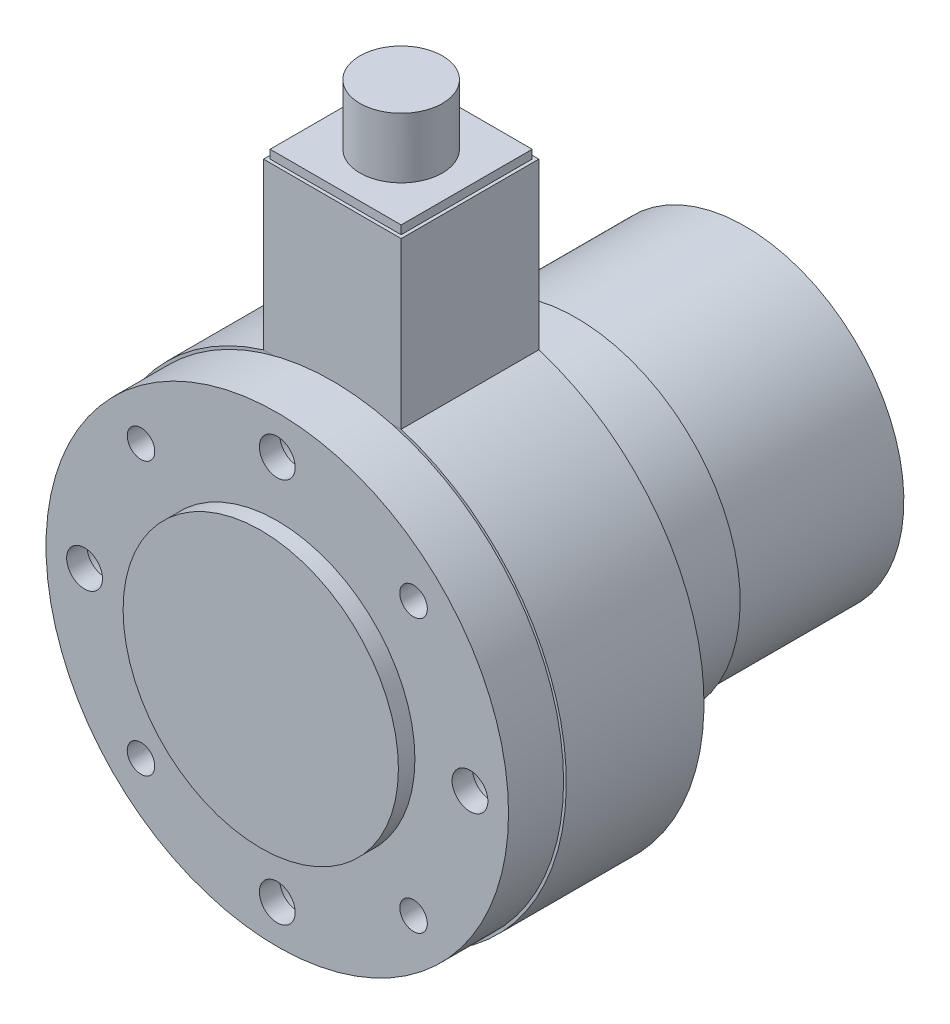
ISO-10303-21;
HEADER;
FILE_DESCRIPTION(('STEP AP214'),'2;1');
FILE_NAME('part.step','',(''),(''),'','','');
FILE_SCHEMA(('AUTOMOTIVE_DESIGN { 1 0 10303 214 1 1 1 1 }'));
ENDSEC;
DATA;
#1=APPLICATION_CONTEXT('core data for automotive mechanical design processes');
#2=APPLICATION_PROTOCOL_DEFINITION('international standard','automotive_design',2000,#1);
#3=PRODUCT_CONTEXT('',#1,'mechanical');
#4=PRODUCT('Part','Part','',(#3));
#5=PRODUCT_RELATED_PRODUCT_CATEGORY('part','',(#4));
#6=PRODUCT_DEFINITION_FORMATION('','',#4);
#7=PRODUCT_DEFINITION_CONTEXT('part definition',#1,'design');
#8=PRODUCT_DEFINITION('design','',#6,#7);
#9=PRODUCT_DEFINITION_SHAPE('','',#8);
#10=(LENGTH_UNIT() NAMED_UNIT(*) SI_UNIT(.MILLI.,.METRE.));
#11=(NAMED_UNIT(*) PLANE_ANGLE_UNIT() SI_UNIT($,.RADIAN.));
#12=(NAMED_UNIT(*) SI_UNIT($,.STERADIAN.) SOLID_ANGLE_UNIT());
#13=UNCERTAINTY_MEASURE_WITH_UNIT(LENGTH_MEASURE(1.E-05),#10,'distance_accuracy_value','');
#14=(GEOMETRIC_REPRESENTATION_CONTEXT(3) GLOBAL_UNCERTAINTY_ASSIGNED_CONTEXT((#13)) GLOBAL_UNIT_ASSIGNED_CONTEXT((#10,
#11,#12)) REPRESENTATION_CONTEXT('',''));
#15=CARTESIAN_POINT('',(0.,0.,0.));
#16=DIRECTION('',(0.,0.,1.));
#17=DIRECTION('',(1.,0.,0.));
#18=AXIS2_PLACEMENT_3D('',#15,#16,#17);
#19=CARTESIAN_POINT('',(0.,0.,-39.));
#20=DIRECTION('',(0.,0.,-1.));
#21=DIRECTION('',(-0.991649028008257,-0.128965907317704,0.));
#22=AXIS2_PLACEMENT_3D('',#19,#20,#21);
#23=CYLINDRICAL_SURFACE('',#22,28.8);
#24=CARTESIAN_POINT('',(0.,0.,-39.));
#25=DIRECTION('',(0.,0.,1.));
#26=DIRECTION('',(0.991649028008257,0.128965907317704,0.));
#27=AXIS2_PLACEMENT_3D('',#24,#25,#26);
#28=CIRCLE('',#27,28.8);
#29=CARTESIAN_POINT('',(28.5594920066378,3.71421813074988,-39.));
#30=VERTEX_POINT('',#29);
#31=EDGE_CURVE('P0_E9',#30,#30,#28,.T.);
#32=ORIENTED_EDGE('',*,*,#31,.F.);
#33=EDGE_LOOP('',(#32));
#34=FACE_BOUND('',#33,.T.);
#35=CARTESIAN_POINT('',(0.,0.,-75.));
#36=DIRECTION('',(0.,0.,1.));
#37=DIRECTION('',(0.991649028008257,0.128965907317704,0.));
#38=AXIS2_PLACEMENT_3D('',#35,#36,#37);
#39=CIRCLE('',#38,28.8);
#40=CARTESIAN_POINT('',(28.5594920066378,3.71421813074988,-75.));
#41=VERTEX_POINT('',#40);
#42=EDGE_CURVE('P0_E16',#41,#41,#39,.T.);
#43=ORIENTED_EDGE('',*,*,#42,.T.);
#44=EDGE_LOOP('',(#43));
#45=FACE_BOUND('',#44,.T.);
#46=ADVANCED_FACE('P0_F13',(#34,#45),#23,.T.);
#47=CARTESIAN_POINT('',(0.,0.,-39.));
#48=DIRECTION('',(0.,0.,1.));
#49=DIRECTION('',(0.991649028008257,0.128965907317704,0.));
#50=AXIS2_PLACEMENT_3D('',#47,#48,#49);
#51=PLANE('',#50);
#52=ORIENTED_EDGE('',*,*,#31,.T.);
#53=EDGE_LOOP('',(#52));
#54=FACE_BOUND('',#53,.T.);
#55=ADVANCED_FACE('P0_F28',(#54),#51,.T.);
#56=CARTESIAN_POINT('',(0.,0.,-75.));
#57=DIRECTION('',(0.,0.,1.));
#58=DIRECTION('',(0.991649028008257,0.128965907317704,0.));
#59=AXIS2_PLACEMENT_3D('',#56,#57,#58);
#60=PLANE('',#59);
#61=ORIENTED_EDGE('',*,*,#42,.F.);
#62=EDGE_LOOP('',(#61));
#63=FACE_BOUND('',#62,.T.);
#64=ADVANCED_FACE('P0_F26',(#63),#60,.F.);
#65=CLOSED_SHELL('',(#46,#55,#64));
#66=MANIFOLD_SOLID_BREP('P0_B1',#65);
#67=CARTESIAN_POINT('',(-11.8999999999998,70.6201920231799,-24.4));
#68=DIRECTION('',(0.,0.,1.));
#69=DIRECTION('',(-1.,0.,0.));
#70=AXIS2_PLACEMENT_3D('',#67,#68,#69);
#71=PLANE('',#70);
#72=DIRECTION('',(1.,0.,0.));
#73=VECTOR('',#72,1.);
#74=CARTESIAN_POINT('',(-11.8999999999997,72.1701920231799,-24.4));
#75=LINE('',#74,#73);
#76=CARTESIAN_POINT('',(-11.8999999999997,72.1701920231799,-24.4));
#77=VERTEX_POINT('',#76);
#78=CARTESIAN_POINT('',(11.9000000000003,72.1701920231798,-24.4));
#79=VERTEX_POINT('',#78);
#80=EDGE_CURVE('P1_E82',#77,#79,#75,.T.);
#81=ORIENTED_EDGE('',*,*,#80,.T.);
#82=DIRECTION('',(0.,1.,0.));
#83=VECTOR('',#82,1.);
#84=CARTESIAN_POINT('',(11.9000000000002,70.6201920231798,-24.4));
#85=LINE('',#84,#83);
#86=CARTESIAN_POINT('',(11.9000000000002,70.6201920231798,-24.4));
#87=VERTEX_POINT('',#86);
#88=EDGE_CURVE('P1_E24',#87,#79,#85,.T.);
#89=ORIENTED_EDGE('',*,*,#88,.F.);
#90=DIRECTION('',(1.,0.,0.));
#91=VECTOR('',#90,1.);
#92=CARTESIAN_POINT('',(-11.8999999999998,70.6201920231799,-24.4));
#93=LINE('',#92,#91);
#94=CARTESIAN_POINT('',(-11.8999999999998,70.6201920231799,-24.4));
#95=VERTEX_POINT('',#94);
#96=EDGE_CURVE('P1_E68',#95,#87,#93,.T.);
#97=ORIENTED_EDGE('',*,*,#96,.F.);
#98=DIRECTION('',(0.,1.,0.));
#99=VECTOR('',#98,1.);
#100=CARTESIAN_POINT('',(-11.8999999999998,70.6201920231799,-24.4));
#101=LINE('',#100,#99);
#102=EDGE_CURVE('P1_E78',#95,#77,#101,.T.);
#103=ORIENTED_EDGE('',*,*,#102,.T.);
#104=EDGE_LOOP('',(#81,#89,#97,#103));
#105=FACE_BOUND('',#104,.T.);
#106=ADVANCED_FACE('P1_F16',(#105),#71,.F.);
#107=CARTESIAN_POINT('',(11.9000000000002,70.6201920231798,-24.4));
#108=DIRECTION('',(-1.,0.,0.));
#109=DIRECTION('',(0.,-1.,0.));
#110=AXIS2_PLACEMENT_3D('',#107,#108,#109);
#111=PLANE('',#110);
#112=DIRECTION('',(0.,0.,1.));
#113=VECTOR('',#112,1.);
#114=CARTESIAN_POINT('',(11.9000000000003,72.1701920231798,-24.4));
#115=LINE('',#114,#113);
#116=CARTESIAN_POINT('',(11.9000000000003,72.1701920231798,-0.599999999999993));
#117=VERTEX_POINT('',#116);
#118=EDGE_CURVE('P1_E73',#79,#117,#115,.T.);
#119=ORIENTED_EDGE('',*,*,#118,.T.);
#120=DIRECTION('',(0.,1.,0.));
#121=VECTOR('',#120,1.);
#122=CARTESIAN_POINT('',(11.9000000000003,70.6201920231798,-0.599999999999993));
#123=LINE('',#122,#121);
#124=CARTESIAN_POINT('',(11.9000000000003,70.6201920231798,-0.599999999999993));
#125=VERTEX_POINT('',#124);
#126=EDGE_CURVE('P1_E71',#125,#117,#123,.T.);
#127=ORIENTED_EDGE('',*,*,#126,.F.);
#128=DIRECTION('',(0.,0.,1.));
#129=VECTOR('',#128,1.);
#130=CARTESIAN_POINT('',(11.9000000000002,70.6201920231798,-24.4));
#131=LINE('',#130,#129);
#132=EDGE_CURVE('P1_E63',#87,#125,#131,.T.);
#133=ORIENTED_EDGE('',*,*,#132,.F.);
#134=ORIENTED_EDGE('',*,*,#88,.T.);
#135=EDGE_LOOP('',(#119,#127,#133,#134));
#136=FACE_BOUND('',#135,.T.);
#137=ADVANCED_FACE('P1_F72',(#136),#111,.F.);
#138=CARTESIAN_POINT('',(-11.8999999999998,70.6201920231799,-0.599999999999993));
#139=DIRECTION('',(0.,0.,-1.));
#140=DIRECTION('',(1.,0.,0.));
#141=AXIS2_PLACEMENT_3D('',#138,#139,#140);
#142=PLANE('',#141);
#143=DIRECTION('',(-1.,0.,0.));
#144=VECTOR('',#143,1.);
#145=CARTESIAN_POINT('',(-11.8999999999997,72.1701920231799,-0.599999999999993));
#146=LINE('',#145,#144);
#147=CARTESIAN_POINT('',(-11.8999999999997,72.1701920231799,-0.599999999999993));
#148=VERTEX_POINT('',#147);
#149=EDGE_CURVE('P1_E49',#117,#148,#146,.T.);
#150=ORIENTED_EDGE('',*,*,#149,.T.);
#151=DIRECTION('',(0.,1.,0.));
#152=VECTOR('',#151,1.);
#153=CARTESIAN_POINT('',(-11.8999999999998,70.6201920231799,-0.599999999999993));
#154=LINE('',#153,#152);
#155=CARTESIAN_POINT('',(-11.8999999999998,70.6201920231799,-0.599999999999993));
#156=VERTEX_POINT('',#155);
#157=EDGE_CURVE('P1_E74',#156,#148,#154,.T.);
#158=ORIENTED_EDGE('',*,*,#157,.F.);
#159=DIRECTION('',(-1.,0.,0.));
#160=VECTOR('',#159,1.);
#161=CARTESIAN_POINT('',(-11.8999999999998,70.6201920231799,-0.599999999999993));
#162=LINE('',#161,#160);
#163=EDGE_CURVE('P1_E66',#125,#156,#162,.T.);
#164=ORIENTED_EDGE('',*,*,#163,.F.);
#165=ORIENTED_EDGE('',*,*,#126,.T.);
#166=EDGE_LOOP('',(#150,#158,#164,#165));
#167=FACE_BOUND('',#166,.T.);
#168=ADVANCED_FACE('P1_F76',(#167),#142,.F.);
#169=CARTESIAN_POINT('',(-11.8999999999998,70.6201920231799,-24.4));
#170=DIRECTION('',(1.,0.,0.));
#171=DIRECTION('',(0.,1.,0.));
#172=AXIS2_PLACEMENT_3D('',#169,#170,#171);
#173=PLANE('',#172);
#174=DIRECTION('',(0.,0.,-1.));
#175=VECTOR('',#174,1.);
#176=CARTESIAN_POINT('',(-11.8999999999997,72.1701920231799,-24.4));
#177=LINE('',#176,#175);
#178=EDGE_CURVE('P1_E55',#148,#77,#177,.T.);
#179=ORIENTED_EDGE('',*,*,#178,.T.);
#180=ORIENTED_EDGE('',*,*,#102,.F.);
#181=DIRECTION('',(0.,0.,-1.));
#182=VECTOR('',#181,1.);
#183=CARTESIAN_POINT('',(-11.8999999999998,70.6201920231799,-24.4));
#184=LINE('',#183,#182);
#185=EDGE_CURVE('P1_E32',#156,#95,#184,.T.);
#186=ORIENTED_EDGE('',*,*,#185,.F.);
#187=ORIENTED_EDGE('',*,*,#157,.T.);
#188=EDGE_LOOP('',(#179,#180,#186,#187));
#189=FACE_BOUND('',#188,.T.);
#190=ADVANCED_FACE('P1_F106',(#189),#173,.F.);
#191=CARTESIAN_POINT('',(11.9000000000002,70.6201920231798,-24.4));
#192=DIRECTION('',(0.,-1.,0.));
#193=DIRECTION('',(0.,0.,1.));
#194=AXIS2_PLACEMENT_3D('',#191,#192,#193);
#195=PLANE('',#194);
#196=ORIENTED_EDGE('',*,*,#96,.T.);
#197=ORIENTED_EDGE('',*,*,#132,.T.);
#198=ORIENTED_EDGE('',*,*,#163,.T.);
#199=ORIENTED_EDGE('',*,*,#185,.T.);
#200=EDGE_LOOP('',(#196,#197,#198,#199));
#201=FACE_BOUND('',#200,.T.);
#202=ADVANCED_FACE('P1_F64',(#201),#195,.T.);
#203=CARTESIAN_POINT('',(11.9000000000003,72.1701920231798,-24.4));
#204=DIRECTION('',(0.,-1.,0.));
#205=DIRECTION('',(0.,0.,1.));
#206=AXIS2_PLACEMENT_3D('',#203,#204,#205);
#207=PLANE('',#206);
#208=CARTESIAN_POINT('',(2.55004350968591E-13,72.1701920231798,-12.5));
#209=DIRECTION('',(0.,-1.,0.));
#210=DIRECTION('',(0.,0.,1.));
#211=AXIS2_PLACEMENT_3D('',#208,#209,#210);
#212=CIRCLE('',#211,7.49);
#213=CARTESIAN_POINT('',(2.55921581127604E-13,72.1701920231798,-5.00999999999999));
#214=VERTEX_POINT('',#213);
#215=EDGE_CURVE('P1_E11',#214,#214,#212,.F.);
#216=ORIENTED_EDGE('',*,*,#215,.F.);
#217=EDGE_LOOP('',(#216));
#218=FACE_BOUND('',#217,.T.);
#219=ORIENTED_EDGE('',*,*,#80,.F.);
#220=ORIENTED_EDGE('',*,*,#178,.F.);
#221=ORIENTED_EDGE('',*,*,#149,.F.);
#222=ORIENTED_EDGE('',*,*,#118,.F.);
#223=EDGE_LOOP('',(#219,#220,#221,#222));
#224=FACE_BOUND('',#223,.T.);
#225=ADVANCED_FACE('P1_F93',(#218,#224),#207,.F.);
#226=CARTESIAN_POINT('',(2.94902990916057E-13,83.1201920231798,-12.5));
#227=DIRECTION('',(0.,-1.,0.));
#228=DIRECTION('',(0.,0.,1.));
#229=AXIS2_PLACEMENT_3D('',#226,#227,#228);
#230=CYLINDRICAL_SURFACE('',#229,7.49);
#231=CARTESIAN_POINT('',(2.94902990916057E-13,83.1201920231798,-12.5));
#232=DIRECTION('',(0.,1.,0.));
#233=DIRECTION('',(0.,0.,-1.));
#234=AXIS2_PLACEMENT_3D('',#231,#232,#233);
#235=CIRCLE('',#234,7.49);
#236=CARTESIAN_POINT('',(2.93985760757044E-13,83.1201920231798,-19.99));
#237=VERTEX_POINT('',#236);
#238=EDGE_CURVE('P1_E85',#237,#237,#235,.T.);
#239=ORIENTED_EDGE('',*,*,#238,.F.);
#240=EDGE_LOOP('',(#239));
#241=FACE_BOUND('',#240,.T.);
#242=ORIENTED_EDGE('',*,*,#215,.T.);
#243=EDGE_LOOP('',(#242));
#244=FACE_BOUND('',#243,.T.);
#245=ADVANCED_FACE('P1_F95',(#241,#244),#230,.T.);
#246=CARTESIAN_POINT('',(2.94902990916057E-13,83.1201920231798,-12.5));
#247=DIRECTION('',(0.,1.,0.));
#248=DIRECTION('',(0.,0.,-1.));
#249=AXIS2_PLACEMENT_3D('',#246,#247,#248);
#250=PLANE('',#249);
#251=ORIENTED_EDGE('',*,*,#238,.T.);
#252=EDGE_LOOP('',(#251));
#253=FACE_BOUND('',#252,.T.);
#254=ADVANCED_FACE('P1_F103',(#253),#250,.T.);
#255=CLOSED_SHELL('',(#106,#137,#168,#190,#202,#225,#245,#254));
#256=MANIFOLD_SOLID_BREP('P1_B1',#255);
#257=CARTESIAN_POINT('',(29.4701448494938,0.,-25.));
#258=DIRECTION('',(0.,0.,-1.));
#259=DIRECTION('',(0.,1.,0.));
#260=AXIS2_PLACEMENT_3D('',#257,#258,#259);
#261=PLANE('',#260);
#262=CARTESIAN_POINT('',(0.,0.,-25.));
#263=DIRECTION('',(0.,0.,1.));
#264=DIRECTION('',(0.,-1.,0.));
#265=AXIS2_PLACEMENT_3D('',#262,#263,#264);
#266=CIRCLE('',#265,29.4701448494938);
#267=CARTESIAN_POINT('',(0.,-29.4701448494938,-25.));
#268=VERTEX_POINT('',#267);
#269=EDGE_CURVE('P2_E28',#268,#268,#266,.T.);
#270=ORIENTED_EDGE('',*,*,#269,.F.);
#271=EDGE_LOOP('',(#270));
#272=FACE_BOUND('',#271,.T.);
#273=CARTESIAN_POINT('',(0.,0.,-25.));
#274=DIRECTION('',(0.,0.,1.));
#275=DIRECTION('',(0.,-1.,0.));
#276=AXIS2_PLACEMENT_3D('',#273,#274,#275);
#277=CIRCLE('',#276,29.7701448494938);
#278=CARTESIAN_POINT('',(0.,-29.7701448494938,-25.));
#279=VERTEX_POINT('',#278);
#280=EDGE_CURVE('P2_E10',#279,#279,#277,.T.);
#281=ORIENTED_EDGE('',*,*,#280,.T.);
#282=EDGE_LOOP('',(#281));
#283=FACE_BOUND('',#282,.T.);
#284=ADVANCED_FACE('P2_F14',(#272,#283),#261,.F.);
#285=CARTESIAN_POINT('',(0.,0.,-19.9714581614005));
#286=DIRECTION('',(0.,0.,1.));
#287=DIRECTION('',(0.,-1.,0.));
#288=AXIS2_PLACEMENT_3D('',#285,#286,#287);
#289=CYLINDRICAL_SURFACE('',#288,29.7701448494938);
#290=ORIENTED_EDGE('',*,*,#280,.F.);
#291=EDGE_LOOP('',(#290));
#292=FACE_BOUND('',#291,.T.);
#293=CARTESIAN_POINT('',(0.,0.,-44.3));
#294=DIRECTION('',(0.,0.,1.));
#295=DIRECTION('',(0.,-1.,0.));
#296=AXIS2_PLACEMENT_3D('',#293,#294,#295);
#297=CIRCLE('',#296,29.7701448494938);
#298=CARTESIAN_POINT('',(0.,-29.7701448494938,-44.3));
#299=VERTEX_POINT('',#298);
#300=EDGE_CURVE('P2_E20',#299,#299,#297,.T.);
#301=ORIENTED_EDGE('',*,*,#300,.T.);
#302=EDGE_LOOP('',(#301));
#303=FACE_BOUND('',#302,.T.);
#304=ADVANCED_FACE('P2_F37',(#292,#303),#289,.T.);
#305=CARTESIAN_POINT('',(29.4701448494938,0.,-44.3));
#306=DIRECTION('',(0.,0.,1.));
#307=DIRECTION('',(0.,-1.,0.));
#308=AXIS2_PLACEMENT_3D('',#305,#306,#307);
#309=PLANE('',#308);
#310=ORIENTED_EDGE('',*,*,#300,.F.);
#311=EDGE_LOOP('',(#310));
#312=FACE_BOUND('',#311,.T.);
#313=CARTESIAN_POINT('',(0.,0.,-44.3));
#314=DIRECTION('',(0.,0.,1.));
#315=DIRECTION('',(0.,-1.,0.));
#316=AXIS2_PLACEMENT_3D('',#313,#314,#315);
#317=CIRCLE('',#316,29.4701448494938);
#318=CARTESIAN_POINT('',(0.,-29.4701448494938,-44.3));
#319=VERTEX_POINT('',#318);
#320=EDGE_CURVE('P2_E24',#319,#319,#317,.T.);
#321=ORIENTED_EDGE('',*,*,#320,.T.);
#322=EDGE_LOOP('',(#321));
#323=FACE_BOUND('',#322,.T.);
#324=ADVANCED_FACE('P2_F42',(#312,#323),#309,.F.);
#325=CARTESIAN_POINT('',(0.,0.,-19.9714581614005));
#326=DIRECTION('',(0.,0.,1.));
#327=DIRECTION('',(0.,-1.,0.));
#328=AXIS2_PLACEMENT_3D('',#325,#326,#327);
#329=CYLINDRICAL_SURFACE('',#328,29.4701448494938);
#330=ORIENTED_EDGE('',*,*,#320,.F.);
#331=EDGE_LOOP('',(#330));
#332=FACE_BOUND('',#331,.T.);
#333=ORIENTED_EDGE('',*,*,#269,.T.);
#334=EDGE_LOOP('',(#333));
#335=FACE_BOUND('',#334,.T.);
#336=ADVANCED_FACE('P2_F34',(#332,#335),#329,.F.);
#337=CLOSED_SHELL('',(#284,#304,#324,#336));
#338=MANIFOLD_SOLID_BREP('P2_B1',#337);
#339=CARTESIAN_POINT('',(12.5000000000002,40.6201920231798,0.));
#340=DIRECTION('',(0.,0.,-1.));
#341=DIRECTION('',(1.,0.,0.));
#342=AXIS2_PLACEMENT_3D('',#339,#340,#341);
#343=PLANE('',#342);
#344=DIRECTION('',(-1.,0.,0.));
#345=VECTOR('',#344,1.);
#346=CARTESIAN_POINT('',(12.5000000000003,70.6201920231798,0.));
#347=LINE('',#346,#345);
#348=CARTESIAN_POINT('',(12.5000000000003,70.6201920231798,0.));
#349=VERTEX_POINT('',#348);
#350=CARTESIAN_POINT('',(-12.4999999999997,70.6201920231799,0.));
#351=VERTEX_POINT('',#350);
#352=EDGE_CURVE('P3_E79',#349,#351,#347,.T.);
#353=ORIENTED_EDGE('',*,*,#352,.T.);
#354=DIRECTION('',(0.,1.,0.));
#355=VECTOR('',#354,1.);
#356=CARTESIAN_POINT('',(-12.4999999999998,40.6201920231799,0.));
#357=LINE('',#356,#355);
#358=CARTESIAN_POINT('',(-12.4999999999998,40.6201920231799,0.));
#359=VERTEX_POINT('',#358);
#360=EDGE_CURVE('P3_E11',#359,#351,#357,.T.);
#361=ORIENTED_EDGE('',*,*,#360,.F.);
#362=DIRECTION('',(-1.,0.,0.));
#363=VECTOR('',#362,1.);
#364=CARTESIAN_POINT('',(12.5000000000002,40.6201920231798,0.));
#365=LINE('',#364,#363);
#366=CARTESIAN_POINT('',(12.5000000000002,40.6201920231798,0.));
#367=VERTEX_POINT('',#366);
#368=EDGE_CURVE('P3_E67',#367,#359,#365,.T.);
#369=ORIENTED_EDGE('',*,*,#368,.F.);
#370=DIRECTION('',(0.,1.,0.));
#371=VECTOR('',#370,1.);
#372=CARTESIAN_POINT('',(12.5000000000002,40.6201920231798,0.));
#373=LINE('',#372,#371);
#374=EDGE_CURVE('P3_E75',#367,#349,#373,.T.);
#375=ORIENTED_EDGE('',*,*,#374,.T.);
#376=EDGE_LOOP('',(#353,#361,#369,#375));
#377=FACE_BOUND('',#376,.T.);
#378=ADVANCED_FACE('P3_F16',(#377),#343,.F.);
#379=CARTESIAN_POINT('',(-12.4999999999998,40.6201920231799,0.));
#380=DIRECTION('',(1.,0.,0.));
#381=DIRECTION('',(0.,-1.,0.));
#382=AXIS2_PLACEMENT_3D('',#379,#380,#381);
#383=PLANE('',#382);
#384=DIRECTION('',(0.,0.,-1.));
#385=VECTOR('',#384,1.);
#386=CARTESIAN_POINT('',(-12.4999999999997,70.6201920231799,0.));
#387=LINE('',#386,#385);
#388=CARTESIAN_POINT('',(-12.4999999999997,70.6201920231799,-25.));
#389=VERTEX_POINT('',#388);
#390=EDGE_CURVE('P3_E71',#351,#389,#387,.T.);
#391=ORIENTED_EDGE('',*,*,#390,.T.);
#392=DIRECTION('',(0.,1.,0.));
#393=VECTOR('',#392,1.);
#394=CARTESIAN_POINT('',(-12.4999999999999,40.6201920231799,-25.));
#395=LINE('',#394,#393);
#396=CARTESIAN_POINT('',(-12.4999999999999,40.6201920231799,-25.));
#397=VERTEX_POINT('',#396);
#398=EDGE_CURVE('P3_E24',#397,#389,#395,.T.);
#399=ORIENTED_EDGE('',*,*,#398,.F.);
#400=DIRECTION('',(0.,0.,-1.));
#401=VECTOR('',#400,1.);
#402=CARTESIAN_POINT('',(-12.4999999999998,40.6201920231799,0.));
#403=LINE('',#402,#401);
#404=EDGE_CURVE('P3_E62',#359,#397,#403,.T.);
#405=ORIENTED_EDGE('',*,*,#404,.F.);
#406=ORIENTED_EDGE('',*,*,#360,.T.);
#407=EDGE_LOOP('',(#391,#399,#405,#406));
#408=FACE_BOUND('',#407,.T.);
#409=ADVANCED_FACE('P3_F70',(#408),#383,.F.);
#410=CARTESIAN_POINT('',(12.5000000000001,40.6201920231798,-25.));
#411=DIRECTION('',(0.,0.,1.));
#412=DIRECTION('',(-1.,0.,0.));
#413=AXIS2_PLACEMENT_3D('',#410,#411,#412);
#414=PLANE('',#413);
#415=DIRECTION('',(1.,0.,0.));
#416=VECTOR('',#415,1.);
#417=CARTESIAN_POINT('',(12.5000000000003,70.6201920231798,-25.));
#418=LINE('',#417,#416);
#419=CARTESIAN_POINT('',(12.5000000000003,70.6201920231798,-25.));
#420=VERTEX_POINT('',#419);
#421=EDGE_CURVE('P3_E49',#389,#420,#418,.T.);
#422=ORIENTED_EDGE('',*,*,#421,.T.);
#423=DIRECTION('',(0.,1.,0.));
#424=VECTOR('',#423,1.);
#425=CARTESIAN_POINT('',(12.5000000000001,40.6201920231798,-25.));
#426=LINE('',#425,#424);
#427=CARTESIAN_POINT('',(12.5000000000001,40.6201920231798,-25.));
#428=VERTEX_POINT('',#427);
#429=EDGE_CURVE('P3_E72',#428,#420,#426,.T.);
#430=ORIENTED_EDGE('',*,*,#429,.F.);
#431=DIRECTION('',(1.,0.,0.));
#432=VECTOR('',#431,1.);
#433=CARTESIAN_POINT('',(12.5000000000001,40.6201920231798,-25.));
#434=LINE('',#433,#432);
#435=EDGE_CURVE('P3_E65',#397,#428,#434,.T.);
#436=ORIENTED_EDGE('',*,*,#435,.F.);
#437=ORIENTED_EDGE('',*,*,#398,.T.);
#438=EDGE_LOOP('',(#422,#430,#436,#437));
#439=FACE_BOUND('',#438,.T.);
#440=ADVANCED_FACE('P3_F73',(#439),#414,.F.);
#441=CARTESIAN_POINT('',(12.5000000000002,40.6201920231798,0.));
#442=DIRECTION('',(-1.,0.,0.));
#443=DIRECTION('',(0.,1.,0.));
#444=AXIS2_PLACEMENT_3D('',#441,#442,#443);
#445=PLANE('',#444);
#446=DIRECTION('',(0.,0.,1.));
#447=VECTOR('',#446,1.);
#448=CARTESIAN_POINT('',(12.5000000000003,70.6201920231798,0.));
#449=LINE('',#448,#447);
#450=EDGE_CURVE('P3_E55',#420,#349,#449,.T.);
#451=ORIENTED_EDGE('',*,*,#450,.T.);
#452=ORIENTED_EDGE('',*,*,#374,.F.);
#453=DIRECTION('',(0.,0.,1.));
#454=VECTOR('',#453,1.);
#455=CARTESIAN_POINT('',(12.5000000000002,40.6201920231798,0.));
#456=LINE('',#455,#454);
#457=EDGE_CURVE('P3_E32',#428,#367,#456,.T.);
#458=ORIENTED_EDGE('',*,*,#457,.F.);
#459=ORIENTED_EDGE('',*,*,#429,.T.);
#460=EDGE_LOOP('',(#451,#452,#458,#459));
#461=FACE_BOUND('',#460,.T.);
#462=ADVANCED_FACE('P3_F86',(#461),#445,.F.);
#463=CARTESIAN_POINT('',(-12.4999999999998,40.6201920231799,0.));
#464=DIRECTION('',(0.,-1.,0.));
#465=DIRECTION('',(0.,0.,-1.));
#466=AXIS2_PLACEMENT_3D('',#463,#464,#465);
#467=PLANE('',#466);
#468=ORIENTED_EDGE('',*,*,#368,.T.);
#469=ORIENTED_EDGE('',*,*,#404,.T.);
#470=ORIENTED_EDGE('',*,*,#435,.T.);
#471=ORIENTED_EDGE('',*,*,#457,.T.);
#472=EDGE_LOOP('',(#468,#469,#470,#471));
#473=FACE_BOUND('',#472,.T.);
#474=ADVANCED_FACE('P3_F63',(#473),#467,.T.);
#475=CARTESIAN_POINT('',(-12.4999999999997,70.6201920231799,0.));
#476=DIRECTION('',(0.,-1.,0.));
#477=DIRECTION('',(0.,0.,-1.));
#478=AXIS2_PLACEMENT_3D('',#475,#476,#477);
#479=PLANE('',#478);
#480=ORIENTED_EDGE('',*,*,#352,.F.);
#481=ORIENTED_EDGE('',*,*,#450,.F.);
#482=ORIENTED_EDGE('',*,*,#421,.F.);
#483=ORIENTED_EDGE('',*,*,#390,.F.);
#484=EDGE_LOOP('',(#480,#481,#482,#483));
#485=FACE_BOUND('',#484,.T.);
#486=ADVANCED_FACE('P3_F89',(#485),#479,.F.);
#487=CLOSED_SHELL('',(#378,#409,#440,#462,#474,#486));
#488=MANIFOLD_SOLID_BREP('P3_B1',#487);
#489=CARTESIAN_POINT('',(0.,0.,10.));
#490=DIRECTION('',(0.,0.,1.));
#491=DIRECTION('',(1.,0.,0.));
#492=AXIS2_PLACEMENT_3D('',#489,#490,#491);
#493=PLANE('',#492);
#494=CARTESIAN_POINT('',(0.,0.,10.));
#495=DIRECTION('',(0.,0.,1.));
#496=DIRECTION('',(1.,0.,0.));
#497=AXIS2_PLACEMENT_3D('',#494,#495,#496);
#498=CIRCLE('',#497,25.);
#499=CARTESIAN_POINT('',(25.,0.,10.));
#500=VERTEX_POINT('',#499);
#501=EDGE_CURVE('P4_E99',#500,#500,#498,.T.);
#502=ORIENTED_EDGE('',*,*,#501,.F.);
#503=EDGE_LOOP('',(#502));
#504=FACE_BOUND('',#503,.T.);
#505=CARTESIAN_POINT('',(0.,0.,10.));
#506=DIRECTION('',(0.,0.,1.));
#507=DIRECTION('',(1.,0.,0.));
#508=AXIS2_PLACEMENT_3D('',#505,#506,#507);
#509=CIRCLE('',#508,42.);
#510=CARTESIAN_POINT('',(42.,0.,10.));
#511=VERTEX_POINT('',#510);
#512=EDGE_CURVE('P4_E10',#511,#511,#509,.T.);
#513=ORIENTED_EDGE('',*,*,#512,.T.);
#514=EDGE_LOOP('',(#513));
#515=FACE_BOUND('',#514,.T.);
#516=CARTESIAN_POINT('',(35.,0.,10.));
#517=DIRECTION('',(0.,0.,-1.));
#518=DIRECTION('',(-1.,0.,0.));
#519=AXIS2_PLACEMENT_3D('',#516,#517,#518);
#520=CIRCLE('',#519,3.25);
#521=CARTESIAN_POINT('',(31.75,0.,10.));
#522=VERTEX_POINT('',#521);
#523=EDGE_CURVE('P4_E30',#522,#522,#520,.T.);
#524=ORIENTED_EDGE('',*,*,#523,.T.);
#525=EDGE_LOOP('',(#524));
#526=FACE_BOUND('',#525,.T.);
#527=CARTESIAN_POINT('',(-1.2220184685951E-13,-35.,10.));
#528=DIRECTION('',(0.,0.,-1.));
#529=DIRECTION('',(0.,1.,0.));
#530=AXIS2_PLACEMENT_3D('',#527,#528,#529);
#531=CIRCLE('',#530,3.25);
#532=CARTESIAN_POINT('',(-1.10854532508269E-13,-31.75,10.));
#533=VERTEX_POINT('',#532);
#534=EDGE_CURVE('P4_E54',#533,#533,#531,.T.);
#535=ORIENTED_EDGE('',*,*,#534,.T.);
#536=EDGE_LOOP('',(#535));
#537=FACE_BOUND('',#536,.T.);
#538=CARTESIAN_POINT('',(-35.,2.44403693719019E-13,10.));
#539=DIRECTION('',(0.,0.,-1.));
#540=DIRECTION('',(1.,0.,0.));
#541=AXIS2_PLACEMENT_3D('',#538,#539,#540);
#542=CIRCLE('',#541,3.25);
#543=CARTESIAN_POINT('',(-31.75,2.21709065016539E-13,10.));
#544=VERTEX_POINT('',#543);
#545=EDGE_CURVE('P4_E60',#544,#544,#542,.T.);
#546=ORIENTED_EDGE('',*,*,#545,.T.);
#547=EDGE_LOOP('',(#546));
#548=FACE_BOUND('',#547,.T.);
#549=CARTESIAN_POINT('',(3.66605540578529E-13,35.,10.));
#550=DIRECTION('',(0.,0.,-1.));
#551=DIRECTION('',(0.,-1.,0.));
#552=AXIS2_PLACEMENT_3D('',#549,#550,#551);
#553=CIRCLE('',#552,3.25);
#554=CARTESIAN_POINT('',(3.32563597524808E-13,31.75,10.));
#555=VERTEX_POINT('',#554);
#556=EDGE_CURVE('P4_E66',#555,#555,#553,.T.);
#557=ORIENTED_EDGE('',*,*,#556,.T.);
#558=EDGE_LOOP('',(#557));
#559=FACE_BOUND('',#558,.T.);
#560=CARTESIAN_POINT('',(-24.7487373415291,24.7487373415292,10.));
#561=DIRECTION('',(0.,0.,-1.));
#562=DIRECTION('',(-1.,0.,0.));
#563=AXIS2_PLACEMENT_3D('',#560,#561,#562);
#564=CIRCLE('',#563,2.5);
#565=CARTESIAN_POINT('',(-27.2487373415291,24.7487373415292,10.));
#566=VERTEX_POINT('',#565);
#567=EDGE_CURVE('P4_E77',#566,#566,#564,.T.);
#568=ORIENTED_EDGE('',*,*,#567,.T.);
#569=EDGE_LOOP('',(#568));
#570=FACE_BOUND('',#569,.T.);
#571=CARTESIAN_POINT('',(24.7487373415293,24.748737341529,10.));
#572=DIRECTION('',(0.,0.,-1.));
#573=DIRECTION('',(-1.,0.,0.));
#574=AXIS2_PLACEMENT_3D('',#571,#572,#573);
#575=CIRCLE('',#574,2.5);
#576=CARTESIAN_POINT('',(22.2487373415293,24.748737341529,10.));
#577=VERTEX_POINT('',#576);
#578=EDGE_CURVE('P4_E83',#577,#577,#575,.T.);
#579=ORIENTED_EDGE('',*,*,#578,.T.);
#580=EDGE_LOOP('',(#579));
#581=FACE_BOUND('',#580,.T.);
#582=CARTESIAN_POINT('',(24.7487373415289,-24.7487373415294,10.));
#583=DIRECTION('',(0.,0.,-1.));
#584=DIRECTION('',(-1.,0.,0.));
#585=AXIS2_PLACEMENT_3D('',#582,#583,#584);
#586=CIRCLE('',#585,2.5);
#587=CARTESIAN_POINT('',(22.2487373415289,-24.7487373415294,10.));
#588=VERTEX_POINT('',#587);
#589=EDGE_CURVE('P4_E89',#588,#588,#586,.T.);
#590=ORIENTED_EDGE('',*,*,#589,.T.);
#591=EDGE_LOOP('',(#590));
#592=FACE_BOUND('',#591,.T.);
#593=CARTESIAN_POINT('',(-24.7487373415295,-24.7487373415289,10.));
#594=DIRECTION('',(0.,0.,-1.));
#595=DIRECTION('',(-1.,0.,0.));
#596=AXIS2_PLACEMENT_3D('',#593,#594,#595);
#597=CIRCLE('',#596,2.5);
#598=CARTESIAN_POINT('',(-27.2487373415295,-24.7487373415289,10.));
#599=VERTEX_POINT('',#598);
#600=EDGE_CURVE('P4_E95',#599,#599,#597,.T.);
#601=ORIENTED_EDGE('',*,*,#600,.T.);
#602=EDGE_LOOP('',(#601));
#603=FACE_BOUND('',#602,.T.);
#604=ADVANCED_FACE('P4_F14',(#504,#515,#526,#537,#548,#559,#570,#581,#592,#603),#493,.T.);
#605=CARTESIAN_POINT('',(0.,0.,10.));
#606=DIRECTION('',(0.,0.,-1.));
#607=DIRECTION('',(-1.,0.,0.));
#608=AXIS2_PLACEMENT_3D('',#605,#606,#607);
#609=CYLINDRICAL_SURFACE('',#608,42.);
#610=ORIENTED_EDGE('',*,*,#512,.F.);
#611=EDGE_LOOP('',(#610));
#612=FACE_BOUND('',#611,.T.);
#613=CARTESIAN_POINT('',(0.,0.,0.));
#614=DIRECTION('',(0.,0.,1.));
#615=DIRECTION('',(1.,0.,0.));
#616=AXIS2_PLACEMENT_3D('',#613,#614,#615);
#617=CIRCLE('',#616,42.);
#618=CARTESIAN_POINT('',(42.,0.,0.));
#619=VERTEX_POINT('',#618);
#620=EDGE_CURVE('P4_E18',#619,#619,#617,.T.);
#621=ORIENTED_EDGE('',*,*,#620,.T.);
#622=EDGE_LOOP('',(#621));
#623=FACE_BOUND('',#622,.T.);
#624=ADVANCED_FACE('P4_F16',(#612,#623),#609,.T.);
#625=CARTESIAN_POINT('',(0.,0.,0.));
#626=DIRECTION('',(0.,0.,1.));
#627=DIRECTION('',(1.,0.,0.));
#628=AXIS2_PLACEMENT_3D('',#625,#626,#627);
#629=PLANE('',#628);
#630=CARTESIAN_POINT('',(-24.7487373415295,-24.7487373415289,0.));
#631=DIRECTION('',(0.,0.,-1.));
#632=DIRECTION('',(-1.,0.,0.));
#633=AXIS2_PLACEMENT_3D('',#630,#631,#632);
#634=CIRCLE('',#633,2.49999999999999);
#635=CARTESIAN_POINT('',(-27.2487373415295,-24.7487373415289,0.));
#636=VERTEX_POINT('',#635);
#637=EDGE_CURVE('P4_E92',#636,#636,#634,.T.);
#638=ORIENTED_EDGE('',*,*,#637,.F.);
#639=EDGE_LOOP('',(#638));
#640=FACE_BOUND('',#639,.T.);
#641=CARTESIAN_POINT('',(24.7487373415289,-24.7487373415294,0.));
#642=DIRECTION('',(0.,0.,-1.));
#643=DIRECTION('',(-1.,0.,0.));
#644=AXIS2_PLACEMENT_3D('',#641,#642,#643);
#645=CIRCLE('',#644,2.49999999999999);
#646=CARTESIAN_POINT('',(22.248737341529,-24.7487373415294,0.));
#647=VERTEX_POINT('',#646);
#648=EDGE_CURVE('P4_E86',#647,#647,#645,.T.);
#649=ORIENTED_EDGE('',*,*,#648,.F.);
#650=EDGE_LOOP('',(#649));
#651=FACE_BOUND('',#650,.T.);
#652=CARTESIAN_POINT('',(24.7487373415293,24.748737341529,0.));
#653=DIRECTION('',(0.,0.,-1.));
#654=DIRECTION('',(-1.,0.,0.));
#655=AXIS2_PLACEMENT_3D('',#652,#653,#654);
#656=CIRCLE('',#655,2.49999999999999);
#657=CARTESIAN_POINT('',(22.2487373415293,24.748737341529,0.));
#658=VERTEX_POINT('',#657);
#659=EDGE_CURVE('P4_E80',#658,#658,#656,.T.);
#660=ORIENTED_EDGE('',*,*,#659,.F.);
#661=EDGE_LOOP('',(#660));
#662=FACE_BOUND('',#661,.T.);
#663=CARTESIAN_POINT('',(-24.7487373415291,24.7487373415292,0.));
#664=DIRECTION('',(0.,0.,-1.));
#665=DIRECTION('',(-1.,0.,0.));
#666=AXIS2_PLACEMENT_3D('',#663,#664,#665);
#667=CIRCLE('',#666,2.49999999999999);
#668=CARTESIAN_POINT('',(-27.2487373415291,24.7487373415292,0.));
#669=VERTEX_POINT('',#668);
#670=EDGE_CURVE('P4_E72',#669,#669,#667,.T.);
#671=ORIENTED_EDGE('',*,*,#670,.F.);
#672=EDGE_LOOP('',(#671));
#673=FACE_BOUND('',#672,.T.);
#674=CARTESIAN_POINT('',(3.66605540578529E-13,35.,0.));
#675=DIRECTION('',(0.,0.,-1.));
#676=DIRECTION('',(0.,-1.,0.));
#677=AXIS2_PLACEMENT_3D('',#674,#675,#676);
#678=CIRCLE('',#677,5.25);
#679=CARTESIAN_POINT('',(3.1161470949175E-13,29.75,0.));
#680=VERTEX_POINT('',#679);
#681=EDGE_CURVE('P4_E51',#680,#680,#678,.T.);
#682=ORIENTED_EDGE('',*,*,#681,.F.);
#683=EDGE_LOOP('',(#682));
#684=FACE_BOUND('',#683,.T.);
#685=CARTESIAN_POINT('',(-35.,2.44403693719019E-13,0.));
#686=DIRECTION('',(0.,0.,-1.));
#687=DIRECTION('',(1.,0.,0.));
#688=AXIS2_PLACEMENT_3D('',#685,#686,#687);
#689=CIRCLE('',#688,5.25);
#690=CARTESIAN_POINT('',(-29.75,2.07743139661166E-13,0.));
#691=VERTEX_POINT('',#690);
#692=EDGE_CURVE('P4_E45',#691,#691,#689,.T.);
#693=ORIENTED_EDGE('',*,*,#692,.F.);
#694=EDGE_LOOP('',(#693));
#695=FACE_BOUND('',#694,.T.);
#696=CARTESIAN_POINT('',(-1.2220184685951E-13,-35.,0.));
#697=DIRECTION('',(0.,0.,-1.));
#698=DIRECTION('',(0.,1.,0.));
#699=AXIS2_PLACEMENT_3D('',#696,#697,#698);
#700=CIRCLE('',#699,5.25);
#701=CARTESIAN_POINT('',(-1.03871569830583E-13,-29.75,0.));
#702=VERTEX_POINT('',#701);
#703=EDGE_CURVE('P4_E39',#702,#702,#700,.T.);
#704=ORIENTED_EDGE('',*,*,#703,.F.);
#705=EDGE_LOOP('',(#704));
#706=FACE_BOUND('',#705,.T.);
#707=CARTESIAN_POINT('',(35.,0.,0.));
#708=DIRECTION('',(0.,0.,-1.));
#709=DIRECTION('',(-1.,0.,0.));
#710=AXIS2_PLACEMENT_3D('',#707,#708,#709);
#711=CIRCLE('',#710,5.25);
#712=CARTESIAN_POINT('',(29.75,0.,0.));
#713=VERTEX_POINT('',#712);
#714=EDGE_CURVE('P4_E27',#713,#713,#711,.T.);
#715=ORIENTED_EDGE('',*,*,#714,.F.);
#716=EDGE_LOOP('',(#715));
#717=FACE_BOUND('',#716,.T.);
#718=ORIENTED_EDGE('',*,*,#620,.F.);
#719=EDGE_LOOP('',(#718));
#720=FACE_BOUND('',#719,.T.);
#721=ADVANCED_FACE('P4_F139',(#640,#651,#662,#673,#684,#695,#706,#717,#720),#629,.F.);
#722=CARTESIAN_POINT('',(35.,0.,6.3));
#723=DIRECTION('',(0.,0.,-1.));
#724=DIRECTION('',(-1.,0.,0.));
#725=AXIS2_PLACEMENT_3D('',#722,#723,#724);
#726=CYLINDRICAL_SURFACE('',#725,5.25);
#727=CARTESIAN_POINT('',(35.,0.,6.3));
#728=DIRECTION('',(0.,0.,-1.));
#729=DIRECTION('',(-1.,0.,0.));
#730=AXIS2_PLACEMENT_3D('',#727,#728,#729);
#731=CIRCLE('',#730,5.25);
#732=CARTESIAN_POINT('',(29.75,0.,6.3));
#733=VERTEX_POINT('',#732);
#734=EDGE_CURVE('P4_E25',#733,#733,#731,.T.);
#735=ORIENTED_EDGE('',*,*,#734,.F.);
#736=EDGE_LOOP('',(#735));
#737=FACE_BOUND('',#736,.T.);
#738=ORIENTED_EDGE('',*,*,#714,.T.);
#739=EDGE_LOOP('',(#738));
#740=FACE_BOUND('',#739,.T.);
#741=ADVANCED_FACE('P4_F142',(#737,#740),#726,.F.);
#742=CARTESIAN_POINT('',(35.,0.,6.3));
#743=DIRECTION('',(0.,0.,-1.));
#744=DIRECTION('',(-1.,0.,0.));
#745=AXIS2_PLACEMENT_3D('',#742,#743,#744);
#746=PLANE('',#745);
#747=CARTESIAN_POINT('',(35.,0.,6.3));
#748=DIRECTION('',(0.,0.,-1.));
#749=DIRECTION('',(-1.,0.,0.));
#750=AXIS2_PLACEMENT_3D('',#747,#748,#749);
#751=CIRCLE('',#750,3.25);
#752=CARTESIAN_POINT('',(31.75,0.,6.3));
#753=VERTEX_POINT('',#752);
#754=EDGE_CURVE('P4_E33',#753,#753,#751,.T.);
#755=ORIENTED_EDGE('',*,*,#754,.F.);
#756=EDGE_LOOP('',(#755));
#757=FACE_BOUND('',#756,.T.);
#758=ORIENTED_EDGE('',*,*,#734,.T.);
#759=EDGE_LOOP('',(#758));
#760=FACE_BOUND('',#759,.T.);
#761=ADVANCED_FACE('P4_F180',(#757,#760),#746,.T.);
#762=CARTESIAN_POINT('',(35.,0.,10.));
#763=DIRECTION('',(0.,0.,-1.));
#764=DIRECTION('',(-1.,0.,0.));
#765=AXIS2_PLACEMENT_3D('',#762,#763,#764);
#766=CYLINDRICAL_SURFACE('',#765,3.25);
#767=ORIENTED_EDGE('',*,*,#523,.F.);
#768=EDGE_LOOP('',(#767));
#769=FACE_BOUND('',#768,.T.);
#770=ORIENTED_EDGE('',*,*,#754,.T.);
#771=EDGE_LOOP('',(#770));
#772=FACE_BOUND('',#771,.T.);
#773=ADVANCED_FACE('P4_F189',(#769,#772),#766,.F.);
#774=CARTESIAN_POINT('',(-1.2220184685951E-13,-35.,6.3));
#775=DIRECTION('',(0.,0.,-1.));
#776=DIRECTION('',(-1.,0.,0.));
#777=AXIS2_PLACEMENT_3D('',#774,#775,#776);
#778=CYLINDRICAL_SURFACE('',#777,5.25);
#779=CARTESIAN_POINT('',(-1.2220184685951E-13,-35.,6.3));
#780=DIRECTION('',(0.,0.,-1.));
#781=DIRECTION('',(0.,1.,0.));
#782=AXIS2_PLACEMENT_3D('',#779,#780,#781);
#783=CIRCLE('',#782,5.25);
#784=CARTESIAN_POINT('',(-1.03871569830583E-13,-29.75,6.3));
#785=VERTEX_POINT('',#784);
#786=EDGE_CURVE('P4_E36',#785,#785,#783,.T.);
#787=ORIENTED_EDGE('',*,*,#786,.F.);
#788=EDGE_LOOP('',(#787));
#789=FACE_BOUND('',#788,.T.);
#790=ORIENTED_EDGE('',*,*,#703,.T.);
#791=EDGE_LOOP('',(#790));
#792=FACE_BOUND('',#791,.T.);
#793=ADVANCED_FACE('P4_F198',(#789,#792),#778,.F.);
#794=CARTESIAN_POINT('',(-1.2220184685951E-13,-35.,6.3));
#795=DIRECTION('',(0.,0.,-1.));
#796=DIRECTION('',(0.,1.,0.));
#797=AXIS2_PLACEMENT_3D('',#794,#795,#796);
#798=PLANE('',#797);
#799=CARTESIAN_POINT('',(-1.2220184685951E-13,-35.,6.3));
#800=DIRECTION('',(0.,0.,-1.));
#801=DIRECTION('',(0.,1.,0.));
#802=AXIS2_PLACEMENT_3D('',#799,#800,#801);
#803=CIRCLE('',#802,3.25);
#804=CARTESIAN_POINT('',(-1.10854532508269E-13,-31.75,6.3));
#805=VERTEX_POINT('',#804);
#806=EDGE_CURVE('P4_E57',#805,#805,#803,.T.);
#807=ORIENTED_EDGE('',*,*,#806,.F.);
#808=EDGE_LOOP('',(#807));
#809=FACE_BOUND('',#808,.T.);
#810=ORIENTED_EDGE('',*,*,#786,.T.);
#811=EDGE_LOOP('',(#810));
#812=FACE_BOUND('',#811,.T.);
#813=ADVANCED_FACE('P4_F207',(#809,#812),#798,.T.);
#814=CARTESIAN_POINT('',(-35.,2.44403693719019E-13,6.3));
#815=DIRECTION('',(0.,0.,-1.));
#816=DIRECTION('',(-1.,0.,0.));
#817=AXIS2_PLACEMENT_3D('',#814,#815,#816);
#818=CYLINDRICAL_SURFACE('',#817,5.25);
#819=CARTESIAN_POINT('',(-35.,2.44403693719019E-13,6.3));
#820=DIRECTION('',(0.,0.,-1.));
#821=DIRECTION('',(1.,0.,0.));
#822=AXIS2_PLACEMENT_3D('',#819,#820,#821);
#823=CIRCLE('',#822,5.25);
#824=CARTESIAN_POINT('',(-29.75,2.07743139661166E-13,6.3));
#825=VERTEX_POINT('',#824);
#826=EDGE_CURVE('P4_E42',#825,#825,#823,.T.);
#827=ORIENTED_EDGE('',*,*,#826,.F.);
#828=EDGE_LOOP('',(#827));
#829=FACE_BOUND('',#828,.T.);
#830=ORIENTED_EDGE('',*,*,#692,.T.);
#831=EDGE_LOOP('',(#830));
#832=FACE_BOUND('',#831,.T.);
#833=ADVANCED_FACE('P4_F216',(#829,#832),#818,.F.);
#834=CARTESIAN_POINT('',(-35.,2.44403693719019E-13,6.3));
#835=DIRECTION('',(0.,0.,-1.));
#836=DIRECTION('',(1.,0.,0.));
#837=AXIS2_PLACEMENT_3D('',#834,#835,#836);
#838=PLANE('',#837);
#839=CARTESIAN_POINT('',(-35.,2.44403693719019E-13,6.3));
#840=DIRECTION('',(0.,0.,-1.));
#841=DIRECTION('',(1.,0.,0.));
#842=AXIS2_PLACEMENT_3D('',#839,#840,#841);
#843=CIRCLE('',#842,3.25);
#844=CARTESIAN_POINT('',(-31.75,2.21709065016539E-13,6.3));
#845=VERTEX_POINT('',#844);
#846=EDGE_CURVE('P4_E63',#845,#845,#843,.T.);
#847=ORIENTED_EDGE('',*,*,#846,.F.);
#848=EDGE_LOOP('',(#847));
#849=FACE_BOUND('',#848,.T.);
#850=ORIENTED_EDGE('',*,*,#826,.T.);
#851=EDGE_LOOP('',(#850));
#852=FACE_BOUND('',#851,.T.);
#853=ADVANCED_FACE('P4_F225',(#849,#852),#838,.T.);
#854=CARTESIAN_POINT('',(3.66605540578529E-13,35.,6.3));
#855=DIRECTION('',(0.,0.,-1.));
#856=DIRECTION('',(-1.,0.,0.));
#857=AXIS2_PLACEMENT_3D('',#854,#855,#856);
#858=CYLINDRICAL_SURFACE('',#857,5.25);
#859=CARTESIAN_POINT('',(3.66605540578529E-13,35.,6.3));
#860=DIRECTION('',(0.,0.,-1.));
#861=DIRECTION('',(0.,-1.,0.));
#862=AXIS2_PLACEMENT_3D('',#859,#860,#861);
#863=CIRCLE('',#862,5.25);
#864=CARTESIAN_POINT('',(3.1161470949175E-13,29.75,6.3));
#865=VERTEX_POINT('',#864);
#866=EDGE_CURVE('P4_E48',#865,#865,#863,.T.);
#867=ORIENTED_EDGE('',*,*,#866,.F.);
#868=EDGE_LOOP('',(#867));
#869=FACE_BOUND('',#868,.T.);
#870=ORIENTED_EDGE('',*,*,#681,.T.);
#871=EDGE_LOOP('',(#870));
#872=FACE_BOUND('',#871,.T.);
#873=ADVANCED_FACE('P4_F234',(#869,#872),#858,.F.);
#874=CARTESIAN_POINT('',(3.66605540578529E-13,35.,6.3));
#875=DIRECTION('',(0.,0.,-1.));
#876=DIRECTION('',(0.,-1.,0.));
#877=AXIS2_PLACEMENT_3D('',#874,#875,#876);
#878=PLANE('',#877);
#879=CARTESIAN_POINT('',(3.66605540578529E-13,35.,6.3));
#880=DIRECTION('',(0.,0.,-1.));
#881=DIRECTION('',(0.,-1.,0.));
#882=AXIS2_PLACEMENT_3D('',#879,#880,#881);
#883=CIRCLE('',#882,3.25);
#884=CARTESIAN_POINT('',(3.32563597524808E-13,31.75,6.3));
#885=VERTEX_POINT('',#884);
#886=EDGE_CURVE('P4_E69',#885,#885,#883,.T.);
#887=ORIENTED_EDGE('',*,*,#886,.F.);
#888=EDGE_LOOP('',(#887));
#889=FACE_BOUND('',#888,.T.);
#890=ORIENTED_EDGE('',*,*,#866,.T.);
#891=EDGE_LOOP('',(#890));
#892=FACE_BOUND('',#891,.T.);
#893=ADVANCED_FACE('P4_F243',(#889,#892),#878,.T.);
#894=CARTESIAN_POINT('',(-1.2220184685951E-13,-35.,10.));
#895=DIRECTION('',(0.,0.,-1.));
#896=DIRECTION('',(-1.,0.,0.));
#897=AXIS2_PLACEMENT_3D('',#894,#895,#896);
#898=CYLINDRICAL_SURFACE('',#897,3.25);
#899=ORIENTED_EDGE('',*,*,#534,.F.);
#900=EDGE_LOOP('',(#899));
#901=FACE_BOUND('',#900,.T.);
#902=ORIENTED_EDGE('',*,*,#806,.T.);
#903=EDGE_LOOP('',(#902));
#904=FACE_BOUND('',#903,.T.);
#905=ADVANCED_FACE('P4_F252',(#901,#904),#898,.F.);
#906=CARTESIAN_POINT('',(-35.,2.44403693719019E-13,10.));
#907=DIRECTION('',(0.,0.,-1.));
#908=DIRECTION('',(-1.,0.,0.));
#909=AXIS2_PLACEMENT_3D('',#906,#907,#908);
#910=CYLINDRICAL_SURFACE('',#909,3.25);
#911=ORIENTED_EDGE('',*,*,#545,.F.);
#912=EDGE_LOOP('',(#911));
#913=FACE_BOUND('',#912,.T.);
#914=ORIENTED_EDGE('',*,*,#846,.T.);
#915=EDGE_LOOP('',(#914));
#916=FACE_BOUND('',#915,.T.);
#917=ADVANCED_FACE('P4_F261',(#913,#916),#910,.F.);
#918=CARTESIAN_POINT('',(3.66605540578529E-13,35.,10.));
#919=DIRECTION('',(0.,0.,-1.));
#920=DIRECTION('',(-1.,0.,0.));
#921=AXIS2_PLACEMENT_3D('',#918,#919,#920);
#922=CYLINDRICAL_SURFACE('',#921,3.25);
#923=ORIENTED_EDGE('',*,*,#556,.F.);
#924=EDGE_LOOP('',(#923));
#925=FACE_BOUND('',#924,.T.);
#926=ORIENTED_EDGE('',*,*,#886,.T.);
#927=EDGE_LOOP('',(#926));
#928=FACE_BOUND('',#927,.T.);
#929=ADVANCED_FACE('P4_F270',(#925,#928),#922,.F.);
#930=CARTESIAN_POINT('',(-24.7487373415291,24.7487373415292,0.));
#931=DIRECTION('',(0.,0.,-1.));
#932=DIRECTION('',(-1.,0.,0.));
#933=AXIS2_PLACEMENT_3D('',#930,#931,#932);
#934=CYLINDRICAL_SURFACE('',#933,2.49999999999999);
#935=ORIENTED_EDGE('',*,*,#567,.F.);
#936=EDGE_LOOP('',(#935));
#937=FACE_BOUND('',#936,.T.);
#938=ORIENTED_EDGE('',*,*,#670,.T.);
#939=EDGE_LOOP('',(#938));
#940=FACE_BOUND('',#939,.T.);
#941=ADVANCED_FACE('P4_F279',(#937,#940),#934,.F.);
#942=CARTESIAN_POINT('',(24.7487373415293,24.748737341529,0.));
#943=DIRECTION('',(0.,0.,-1.));
#944=DIRECTION('',(-1.,0.,0.));
#945=AXIS2_PLACEMENT_3D('',#942,#943,#944);
#946=CYLINDRICAL_SURFACE('',#945,2.49999999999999);
#947=ORIENTED_EDGE('',*,*,#578,.F.);
#948=EDGE_LOOP('',(#947));
#949=FACE_BOUND('',#948,.T.);
#950=ORIENTED_EDGE('',*,*,#659,.T.);
#951=EDGE_LOOP('',(#950));
#952=FACE_BOUND('',#951,.T.);
#953=ADVANCED_FACE('P4_F289',(#949,#952),#946,.F.);
#954=CARTESIAN_POINT('',(24.7487373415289,-24.7487373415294,0.));
#955=DIRECTION('',(0.,0.,-1.));
#956=DIRECTION('',(-1.,0.,0.));
#957=AXIS2_PLACEMENT_3D('',#954,#955,#956);
#958=CYLINDRICAL_SURFACE('',#957,2.49999999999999);
#959=ORIENTED_EDGE('',*,*,#589,.F.);
#960=EDGE_LOOP('',(#959));
#961=FACE_BOUND('',#960,.T.);
#962=ORIENTED_EDGE('',*,*,#648,.T.);
#963=EDGE_LOOP('',(#962));
#964=FACE_BOUND('',#963,.T.);
#965=ADVANCED_FACE('P4_F135',(#961,#964),#958,.F.);
#966=CARTESIAN_POINT('',(-24.7487373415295,-24.7487373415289,0.));
#967=DIRECTION('',(0.,0.,-1.));
#968=DIRECTION('',(-1.,0.,0.));
#969=AXIS2_PLACEMENT_3D('',#966,#967,#968);
#970=CYLINDRICAL_SURFACE('',#969,2.49999999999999);
#971=ORIENTED_EDGE('',*,*,#600,.F.);
#972=EDGE_LOOP('',(#971));
#973=FACE_BOUND('',#972,.T.);
#974=ORIENTED_EDGE('',*,*,#637,.T.);
#975=EDGE_LOOP('',(#974));
#976=FACE_BOUND('',#975,.T.);
#977=ADVANCED_FACE('P4_F110',(#973,#976),#970,.F.);
#978=CARTESIAN_POINT('',(0.,0.,13.));
#979=DIRECTION('',(0.,0.,-1.));
#980=DIRECTION('',(-1.,0.,0.));
#981=AXIS2_PLACEMENT_3D('',#978,#979,#980);
#982=CYLINDRICAL_SURFACE('',#981,25.);
#983=CARTESIAN_POINT('',(0.,0.,13.));
#984=DIRECTION('',(0.,0.,1.));
#985=DIRECTION('',(1.,0.,0.));
#986=AXIS2_PLACEMENT_3D('',#983,#984,#985);
#987=CIRCLE('',#986,25.);
#988=CARTESIAN_POINT('',(25.,0.,13.));
#989=VERTEX_POINT('',#988);
#990=EDGE_CURVE('P4_E98',#989,#989,#987,.T.);
#991=ORIENTED_EDGE('',*,*,#990,.F.);
#992=EDGE_LOOP('',(#991));
#993=FACE_BOUND('',#992,.T.);
#994=ORIENTED_EDGE('',*,*,#501,.T.);
#995=EDGE_LOOP('',(#994));
#996=FACE_BOUND('',#995,.T.);
#997=ADVANCED_FACE('P4_F107',(#993,#996),#982,.T.);
#998=CARTESIAN_POINT('',(0.,0.,13.));
#999=DIRECTION('',(0.,0.,1.));
#1000=DIRECTION('',(1.,0.,0.));
#1001=AXIS2_PLACEMENT_3D('',#998,#999,#1000);
#1002=PLANE('',#1001);
#1003=ORIENTED_EDGE('',*,*,#990,.T.);
#1004=EDGE_LOOP('',(#1003));
#1005=FACE_BOUND('',#1004,.T.);
#1006=ADVANCED_FACE('P4_F105',(#1005),#1002,.T.);
#1007=CLOSED_SHELL('',(#604,#624,#721,#741,#761,#773,#793,#813,#833,#853,#873,#893,#905,#917,
#929,#941,#953,#965,#977,#997,#1006));
#1008=MANIFOLD_SOLID_BREP('P4_B1',#1007);
#1009=CARTESIAN_POINT('',(0.,0.,0.));
#1010=DIRECTION('',(0.,0.,-1.));
#1011=DIRECTION('',(1.,0.,0.));
#1012=AXIS2_PLACEMENT_3D('',#1009,#1010,#1011);
#1013=PLANE('',#1012);
#1014=CARTESIAN_POINT('',(24.7487373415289,-24.7487373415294,0.));
#1015=DIRECTION('',(0.,0.,-1.));
#1016=DIRECTION('',(0.,1.,0.));
#1017=AXIS2_PLACEMENT_3D('',#1014,#1015,#1016);
#1018=CIRCLE('',#1017,3.2);
#1019=CARTESIAN_POINT('',(24.748737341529,-21.5487373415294,0.));
#1020=VERTEX_POINT('',#1019);
#1021=EDGE_CURVE('P5_E100',#1020,#1020,#1018,.T.);
#1022=ORIENTED_EDGE('',*,*,#1021,.T.);
#1023=EDGE_LOOP('',(#1022));
#1024=FACE_BOUND('',#1023,.T.);
#1025=CARTESIAN_POINT('',(24.7487373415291,24.7487373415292,0.));
#1026=DIRECTION('',(0.,0.,-1.));
#1027=DIRECTION('',(-1.,0.,0.));
#1028=AXIS2_PLACEMENT_3D('',#1025,#1026,#1027);
#1029=CIRCLE('',#1028,3.2);
#1030=CARTESIAN_POINT('',(21.5487373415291,24.7487373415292,0.));
#1031=VERTEX_POINT('',#1030);
#1032=EDGE_CURVE('P5_E94',#1031,#1031,#1029,.T.);
#1033=ORIENTED_EDGE('',*,*,#1032,.T.);
#1034=EDGE_LOOP('',(#1033));
#1035=FACE_BOUND('',#1034,.T.);
#1036=CARTESIAN_POINT('',(-24.7487373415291,24.7487373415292,0.));
#1037=DIRECTION('',(0.,0.,-1.));
#1038=DIRECTION('',(0.,-1.,0.));
#1039=AXIS2_PLACEMENT_3D('',#1036,#1037,#1038);
#1040=CIRCLE('',#1039,3.2);
#1041=CARTESIAN_POINT('',(-24.7487373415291,21.5487373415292,0.));
#1042=VERTEX_POINT('',#1041);
#1043=EDGE_CURVE('P5_E88',#1042,#1042,#1040,.T.);
#1044=ORIENTED_EDGE('',*,*,#1043,.T.);
#1045=EDGE_LOOP('',(#1044));
#1046=FACE_BOUND('',#1045,.T.);
#1047=CARTESIAN_POINT('',(-24.7487373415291,-24.7487373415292,0.));
#1048=DIRECTION('',(0.,0.,-1.));
#1049=DIRECTION('',(1.,0.,0.));
#1050=AXIS2_PLACEMENT_3D('',#1047,#1048,#1049);
#1051=CIRCLE('',#1050,3.2);
#1052=CARTESIAN_POINT('',(-21.5487373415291,-24.7487373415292,0.));
#1053=VERTEX_POINT('',#1052);
#1054=EDGE_CURVE('P5_E64',#1053,#1053,#1051,.T.);
#1055=ORIENTED_EDGE('',*,*,#1054,.T.);
#1056=EDGE_LOOP('',(#1055));
#1057=FACE_BOUND('',#1056,.T.);
#1058=CARTESIAN_POINT('',(0.,0.,0.));
#1059=DIRECTION('',(0.,0.,-1.));
#1060=DIRECTION('',(1.,0.,0.));
#1061=AXIS2_PLACEMENT_3D('',#1058,#1059,#1060);
#1062=CIRCLE('',#1061,42.5);
#1063=CARTESIAN_POINT('',(12.5000000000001,40.6201920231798,0.));
#1064=VERTEX_POINT('',#1063);
#1065=CARTESIAN_POINT('',(-12.4999999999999,40.6201920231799,0.));
#1066=VERTEX_POINT('',#1065);
#1067=EDGE_CURVE('P5_E10',#1064,#1066,#1062,.T.);
#1068=ORIENTED_EDGE('',*,*,#1067,.F.);
#1069=DIRECTION('',(-1.,0.,0.));
#1070=VECTOR('',#1069,1.);
#1071=CARTESIAN_POINT('',(-12.4999999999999,40.6201920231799,0.));
#1072=LINE('',#1071,#1070);
#1073=EDGE_CURVE('P5_E44',#1064,#1066,#1072,.T.);
#1074=ORIENTED_EDGE('',*,*,#1073,.T.);
#1075=EDGE_LOOP('',(#1068,#1074));
#1076=FACE_BOUND('',#1075,.T.);
#1077=ADVANCED_FACE('P5_F15',(#1024,#1035,#1046,#1057,#1076),#1013,.F.);
#1078=CARTESIAN_POINT('',(0.,0.,-39.));
#1079=DIRECTION('',(0.,0.,-1.));
#1080=DIRECTION('',(1.,0.,0.));
#1081=AXIS2_PLACEMENT_3D('',#1078,#1079,#1080);
#1082=CYLINDRICAL_SURFACE('',#1081,42.5);
#1083=ORIENTED_EDGE('',*,*,#1067,.T.);
#1084=DIRECTION('',(0.,0.,-1.));
#1085=VECTOR('',#1084,1.);
#1086=CARTESIAN_POINT('',(-12.4999999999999,40.6201920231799,0.));
#1087=LINE('',#1086,#1085);
#1088=CARTESIAN_POINT('',(-12.4999999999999,40.6201920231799,-25.));
#1089=VERTEX_POINT('',#1088);
#1090=EDGE_CURVE('P5_E35',#1066,#1089,#1087,.T.);
#1091=ORIENTED_EDGE('',*,*,#1090,.T.);
#1092=CARTESIAN_POINT('',(0.,0.,-25.));
#1093=DIRECTION('',(0.,0.,-1.));
#1094=DIRECTION('',(1.,0.,0.));
#1095=AXIS2_PLACEMENT_3D('',#1092,#1093,#1094);
#1096=CIRCLE('',#1095,42.5);
#1097=CARTESIAN_POINT('',(12.5000000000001,40.6201920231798,-25.));
#1098=VERTEX_POINT('',#1097);
#1099=EDGE_CURVE('P5_E22',#1098,#1089,#1096,.T.);
#1100=ORIENTED_EDGE('',*,*,#1099,.F.);
#1101=DIRECTION('',(0.,0.,-1.));
#1102=VECTOR('',#1101,1.);
#1103=CARTESIAN_POINT('',(12.5000000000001,40.6201920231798,0.));
#1104=LINE('',#1103,#1102);
#1105=EDGE_CURVE('P5_E29',#1064,#1098,#1104,.T.);
#1106=ORIENTED_EDGE('',*,*,#1105,.F.);
#1107=EDGE_LOOP('',(#1083,#1091,#1100,#1106));
#1108=FACE_BOUND('',#1107,.T.);
#1109=ADVANCED_FACE('P5_F48',(#1108),#1082,.T.);
#1110=CARTESIAN_POINT('',(-1.13185849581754E-13,-28.8,-25.));
#1111=DIRECTION('',(0.,0.,1.));
#1112=DIRECTION('',(-1.,0.,0.));
#1113=AXIS2_PLACEMENT_3D('',#1110,#1111,#1112);
#1114=PLANE('',#1113);
#1115=CARTESIAN_POINT('',(24.7487373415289,-24.7487373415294,-25.));
#1116=DIRECTION('',(0.,0.,-1.));
#1117=DIRECTION('',(0.,1.,0.));
#1118=AXIS2_PLACEMENT_3D('',#1115,#1116,#1117);
#1119=CIRCLE('',#1118,5.2);
#1120=CARTESIAN_POINT('',(24.748737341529,-19.5487373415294,-25.));
#1121=VERTEX_POINT('',#1120);
#1122=EDGE_CURVE('P5_E85',#1121,#1121,#1119,.T.);
#1123=ORIENTED_EDGE('',*,*,#1122,.F.);
#1124=EDGE_LOOP('',(#1123));
#1125=FACE_BOUND('',#1124,.T.);
#1126=CARTESIAN_POINT('',(24.7487373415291,24.7487373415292,-25.));
#1127=DIRECTION('',(0.,0.,-1.));
#1128=DIRECTION('',(-1.,0.,0.));
#1129=AXIS2_PLACEMENT_3D('',#1126,#1127,#1128);
#1130=CIRCLE('',#1129,5.2);
#1131=CARTESIAN_POINT('',(19.5487373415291,24.7487373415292,-25.));
#1132=VERTEX_POINT('',#1131);
#1133=EDGE_CURVE('P5_E79',#1132,#1132,#1130,.T.);
#1134=ORIENTED_EDGE('',*,*,#1133,.F.);
#1135=EDGE_LOOP('',(#1134));
#1136=FACE_BOUND('',#1135,.T.);
#1137=CARTESIAN_POINT('',(-24.7487373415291,24.7487373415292,-25.));
#1138=DIRECTION('',(0.,0.,-1.));
#1139=DIRECTION('',(0.,-1.,0.));
#1140=AXIS2_PLACEMENT_3D('',#1137,#1138,#1139);
#1141=CIRCLE('',#1140,5.2);
#1142=CARTESIAN_POINT('',(-24.7487373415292,19.5487373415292,-25.));
#1143=VERTEX_POINT('',#1142);
#1144=EDGE_CURVE('P5_E73',#1143,#1143,#1141,.T.);
#1145=ORIENTED_EDGE('',*,*,#1144,.F.);
#1146=EDGE_LOOP('',(#1145));
#1147=FACE_BOUND('',#1146,.T.);
#1148=CARTESIAN_POINT('',(-24.7487373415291,-24.7487373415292,-25.));
#1149=DIRECTION('',(0.,0.,-1.));
#1150=DIRECTION('',(1.,0.,0.));
#1151=AXIS2_PLACEMENT_3D('',#1148,#1149,#1150);
#1152=CIRCLE('',#1151,5.2);
#1153=CARTESIAN_POINT('',(-19.5487373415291,-24.7487373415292,-25.));
#1154=VERTEX_POINT('',#1153);
#1155=EDGE_CURVE('P5_E61',#1154,#1154,#1152,.T.);
#1156=ORIENTED_EDGE('',*,*,#1155,.F.);
#1157=EDGE_LOOP('',(#1156));
#1158=FACE_BOUND('',#1157,.T.);
#1159=CARTESIAN_POINT('',(0.,0.,-25.));
#1160=DIRECTION('',(0.,0.,-1.));
#1161=DIRECTION('',(1.,0.,0.));
#1162=AXIS2_PLACEMENT_3D('',#1159,#1160,#1161);
#1163=CIRCLE('',#1162,28.8);
#1164=CARTESIAN_POINT('',(28.8,-1.00447428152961E-13,-25.));
#1165=VERTEX_POINT('',#1164);
#1166=EDGE_CURVE('P5_E53',#1165,#1165,#1163,.T.);
#1167=ORIENTED_EDGE('',*,*,#1166,.F.);
#1168=EDGE_LOOP('',(#1167));
#1169=FACE_BOUND('',#1168,.T.);
#1170=ORIENTED_EDGE('',*,*,#1099,.T.);
#1171=DIRECTION('',(-1.,0.,0.));
#1172=VECTOR('',#1171,1.);
#1173=CARTESIAN_POINT('',(-12.4999999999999,40.6201920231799,-25.));
#1174=LINE('',#1173,#1172);
#1175=EDGE_CURVE('P5_E39',#1098,#1089,#1174,.T.);
#1176=ORIENTED_EDGE('',*,*,#1175,.F.);
#1177=EDGE_LOOP('',(#1170,#1176));
#1178=FACE_BOUND('',#1177,.T.);
#1179=ADVANCED_FACE('P5_F52',(#1125,#1136,#1147,#1158,#1169,#1178),#1114,.F.);
#1180=CARTESIAN_POINT('',(0.,0.,-39.));
#1181=DIRECTION('',(0.,0.,-1.));
#1182=DIRECTION('',(1.,0.,0.));
#1183=AXIS2_PLACEMENT_3D('',#1180,#1181,#1182);
#1184=CYLINDRICAL_SURFACE('',#1183,28.8);
#1185=CARTESIAN_POINT('',(0.,0.,-39.));
#1186=DIRECTION('',(0.,0.,-1.));
#1187=DIRECTION('',(1.,0.,0.));
#1188=AXIS2_PLACEMENT_3D('',#1185,#1186,#1187);
#1189=CIRCLE('',#1188,28.8);
#1190=CARTESIAN_POINT('',(28.8,-1.00447428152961E-13,-39.));
#1191=VERTEX_POINT('',#1190);
#1192=EDGE_CURVE('P5_E55',#1191,#1191,#1189,.T.);
#1193=ORIENTED_EDGE('',*,*,#1192,.F.);
#1194=EDGE_LOOP('',(#1193));
#1195=FACE_BOUND('',#1194,.T.);
#1196=ORIENTED_EDGE('',*,*,#1166,.T.);
#1197=EDGE_LOOP('',(#1196));
#1198=FACE_BOUND('',#1197,.T.);
#1199=ADVANCED_FACE('P5_F134',(#1195,#1198),#1184,.T.);
#1200=CARTESIAN_POINT('',(0.,0.,-39.));
#1201=DIRECTION('',(0.,0.,1.));
#1202=DIRECTION('',(-1.,0.,0.));
#1203=AXIS2_PLACEMENT_3D('',#1200,#1201,#1202);
#1204=PLANE('',#1203);
#1205=ORIENTED_EDGE('',*,*,#1192,.T.);
#1206=EDGE_LOOP('',(#1205));
#1207=FACE_BOUND('',#1206,.T.);
#1208=ADVANCED_FACE('P5_F145',(#1207),#1204,.F.);
#1209=CARTESIAN_POINT('',(-24.7487373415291,-24.7487373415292,-10.));
#1210=DIRECTION('',(0.,0.,-1.));
#1211=DIRECTION('',(1.,0.,0.));
#1212=AXIS2_PLACEMENT_3D('',#1209,#1210,#1211);
#1213=CYLINDRICAL_SURFACE('',#1212,5.2);
#1214=CARTESIAN_POINT('',(-24.7487373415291,-24.7487373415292,-10.));
#1215=DIRECTION('',(0.,0.,-1.));
#1216=DIRECTION('',(1.,0.,0.));
#1217=AXIS2_PLACEMENT_3D('',#1214,#1215,#1216);
#1218=CIRCLE('',#1217,5.2);
#1219=CARTESIAN_POINT('',(-19.5487373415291,-24.7487373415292,-10.));
#1220=VERTEX_POINT('',#1219);
#1221=EDGE_CURVE('P5_E60',#1220,#1220,#1218,.T.);
#1222=ORIENTED_EDGE('',*,*,#1221,.F.);
#1223=EDGE_LOOP('',(#1222));
#1224=FACE_BOUND('',#1223,.T.);
#1225=ORIENTED_EDGE('',*,*,#1155,.T.);
#1226=EDGE_LOOP('',(#1225));
#1227=FACE_BOUND('',#1226,.T.);
#1228=ADVANCED_FACE('P5_F152',(#1224,#1227),#1213,.F.);
#1229=CARTESIAN_POINT('',(-24.7487373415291,-24.7487373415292,-10.));
#1230=DIRECTION('',(0.,0.,-1.));
#1231=DIRECTION('',(1.,0.,0.));
#1232=AXIS2_PLACEMENT_3D('',#1229,#1230,#1231);
#1233=PLANE('',#1232);
#1234=CARTESIAN_POINT('',(-24.7487373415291,-24.7487373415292,-10.));
#1235=DIRECTION('',(0.,0.,-1.));
#1236=DIRECTION('',(1.,0.,0.));
#1237=AXIS2_PLACEMENT_3D('',#1234,#1235,#1236);
#1238=CIRCLE('',#1237,3.2);
#1239=CARTESIAN_POINT('',(-21.5487373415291,-24.7487373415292,-10.));
#1240=VERTEX_POINT('',#1239);
#1241=EDGE_CURVE('P5_E50',#1240,#1240,#1238,.T.);
#1242=ORIENTED_EDGE('',*,*,#1241,.F.);
#1243=EDGE_LOOP('',(#1242));
#1244=FACE_BOUND('',#1243,.T.);
#1245=ORIENTED_EDGE('',*,*,#1221,.T.);
#1246=EDGE_LOOP('',(#1245));
#1247=FACE_BOUND('',#1246,.T.);
#1248=ADVANCED_FACE('P5_F190',(#1244,#1247),#1233,.T.);
#1249=CARTESIAN_POINT('',(-24.7487373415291,-24.7487373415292,0.));
#1250=DIRECTION('',(0.,0.,-1.));
#1251=DIRECTION('',(1.,0.,0.));
#1252=AXIS2_PLACEMENT_3D('',#1249,#1250,#1251);
#1253=CYLINDRICAL_SURFACE('',#1252,3.2);
#1254=ORIENTED_EDGE('',*,*,#1054,.F.);
#1255=EDGE_LOOP('',(#1254));
#1256=FACE_BOUND('',#1255,.T.);
#1257=ORIENTED_EDGE('',*,*,#1241,.T.);
#1258=EDGE_LOOP('',(#1257));
#1259=FACE_BOUND('',#1258,.T.);
#1260=ADVANCED_FACE('P5_F200',(#1256,#1259),#1253,.F.);
#1261=CARTESIAN_POINT('',(-12.4999999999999,40.6201920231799,0.));
#1262=DIRECTION('',(0.,-1.,0.));
#1263=DIRECTION('',(-1.,0.,0.));
#1264=AXIS2_PLACEMENT_3D('',#1261,#1262,#1263);
#1265=PLANE('',#1264);
#1266=ORIENTED_EDGE('',*,*,#1175,.T.);
#1267=ORIENTED_EDGE('',*,*,#1090,.F.);
#1268=ORIENTED_EDGE('',*,*,#1073,.F.);
#1269=ORIENTED_EDGE('',*,*,#1105,.T.);
#1270=EDGE_LOOP('',(#1266,#1267,#1268,#1269));
#1271=FACE_BOUND('',#1270,.T.);
#1272=ADVANCED_FACE('P5_F40',(#1271),#1265,.F.);
#1273=CARTESIAN_POINT('',(-24.7487373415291,24.7487373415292,-10.));
#1274=DIRECTION('',(0.,0.,-1.));
#1275=DIRECTION('',(1.,0.,0.));
#1276=AXIS2_PLACEMENT_3D('',#1273,#1274,#1275);
#1277=CYLINDRICAL_SURFACE('',#1276,5.2);
#1278=CARTESIAN_POINT('',(-24.7487373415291,24.7487373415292,-10.));
#1279=DIRECTION('',(0.,0.,-1.));
#1280=DIRECTION('',(0.,-1.,0.));
#1281=AXIS2_PLACEMENT_3D('',#1278,#1279,#1280);
#1282=CIRCLE('',#1281,5.2);
#1283=CARTESIAN_POINT('',(-24.7487373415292,19.5487373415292,-10.));
#1284=VERTEX_POINT('',#1283);
#1285=EDGE_CURVE('P5_E45',#1284,#1284,#1282,.T.);
#1286=ORIENTED_EDGE('',*,*,#1285,.F.);
#1287=EDGE_LOOP('',(#1286));
#1288=FACE_BOUND('',#1287,.T.);
#1289=ORIENTED_EDGE('',*,*,#1144,.T.);
#1290=EDGE_LOOP('',(#1289));
#1291=FACE_BOUND('',#1290,.T.);
#1292=ADVANCED_FACE('P5_F219',(#1288,#1291),#1277,.F.);
#1293=CARTESIAN_POINT('',(-24.7487373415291,24.7487373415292,-10.));
#1294=DIRECTION('',(0.,0.,-1.));
#1295=DIRECTION('',(0.,-1.,0.));
#1296=AXIS2_PLACEMENT_3D('',#1293,#1294,#1295);
#1297=PLANE('',#1296);
#1298=CARTESIAN_POINT('',(-24.7487373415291,24.7487373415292,-10.));
#1299=DIRECTION('',(0.,0.,-1.));
#1300=DIRECTION('',(0.,-1.,0.));
#1301=AXIS2_PLACEMENT_3D('',#1298,#1299,#1300);
#1302=CIRCLE('',#1301,3.2);
#1303=CARTESIAN_POINT('',(-24.7487373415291,21.5487373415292,-10.));
#1304=VERTEX_POINT('',#1303);
#1305=EDGE_CURVE('P5_E91',#1304,#1304,#1302,.T.);
#1306=ORIENTED_EDGE('',*,*,#1305,.F.);
#1307=EDGE_LOOP('',(#1306));
#1308=FACE_BOUND('',#1307,.T.);
#1309=ORIENTED_EDGE('',*,*,#1285,.T.);
#1310=EDGE_LOOP('',(#1309));
#1311=FACE_BOUND('',#1310,.T.);
#1312=ADVANCED_FACE('P5_F228',(#1308,#1311),#1297,.T.);
#1313=CARTESIAN_POINT('',(24.7487373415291,24.7487373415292,-10.));
#1314=DIRECTION('',(0.,0.,-1.));
#1315=DIRECTION('',(1.,0.,0.));
#1316=AXIS2_PLACEMENT_3D('',#1313,#1314,#1315);
#1317=CYLINDRICAL_SURFACE('',#1316,5.2);
#1318=CARTESIAN_POINT('',(24.7487373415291,24.7487373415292,-10.));
#1319=DIRECTION('',(0.,0.,-1.));
#1320=DIRECTION('',(-1.,0.,0.));
#1321=AXIS2_PLACEMENT_3D('',#1318,#1319,#1320);
#1322=CIRCLE('',#1321,5.2);
#1323=CARTESIAN_POINT('',(19.5487373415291,24.7487373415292,-10.));
#1324=VERTEX_POINT('',#1323);
#1325=EDGE_CURVE('P5_E76',#1324,#1324,#1322,.T.);
#1326=ORIENTED_EDGE('',*,*,#1325,.F.);
#1327=EDGE_LOOP('',(#1326));
#1328=FACE_BOUND('',#1327,.T.);
#1329=ORIENTED_EDGE('',*,*,#1133,.T.);
#1330=EDGE_LOOP('',(#1329));
#1331=FACE_BOUND('',#1330,.T.);
#1332=ADVANCED_FACE('P5_F238',(#1328,#1331),#1317,.F.);
#1333=CARTESIAN_POINT('',(24.7487373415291,24.7487373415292,-10.));
#1334=DIRECTION('',(0.,0.,-1.));
#1335=DIRECTION('',(-1.,0.,0.));
#1336=AXIS2_PLACEMENT_3D('',#1333,#1334,#1335);
#1337=PLANE('',#1336);
#1338=CARTESIAN_POINT('',(24.7487373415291,24.7487373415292,-10.));
#1339=DIRECTION('',(0.,0.,-1.));
#1340=DIRECTION('',(-1.,0.,0.));
#1341=AXIS2_PLACEMENT_3D('',#1338,#1339,#1340);
#1342=CIRCLE('',#1341,3.2);
#1343=CARTESIAN_POINT('',(21.5487373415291,24.7487373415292,-10.));
#1344=VERTEX_POINT('',#1343);
#1345=EDGE_CURVE('P5_E97',#1344,#1344,#1342,.T.);
#1346=ORIENTED_EDGE('',*,*,#1345,.F.);
#1347=EDGE_LOOP('',(#1346));
#1348=FACE_BOUND('',#1347,.T.);
#1349=ORIENTED_EDGE('',*,*,#1325,.T.);
#1350=EDGE_LOOP('',(#1349));
#1351=FACE_BOUND('',#1350,.T.);
#1352=ADVANCED_FACE('P5_F128',(#1348,#1351),#1337,.T.);
#1353=CARTESIAN_POINT('',(24.7487373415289,-24.7487373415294,-10.));
#1354=DIRECTION('',(0.,0.,-1.));
#1355=DIRECTION('',(1.,0.,0.));
#1356=AXIS2_PLACEMENT_3D('',#1353,#1354,#1355);
#1357=CYLINDRICAL_SURFACE('',#1356,5.2);
#1358=CARTESIAN_POINT('',(24.7487373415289,-24.7487373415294,-10.));
#1359=DIRECTION('',(0.,0.,-1.));
#1360=DIRECTION('',(0.,1.,0.));
#1361=AXIS2_PLACEMENT_3D('',#1358,#1359,#1360);
#1362=CIRCLE('',#1361,5.2);
#1363=CARTESIAN_POINT('',(24.748737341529,-19.5487373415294,-10.));
#1364=VERTEX_POINT('',#1363);
#1365=EDGE_CURVE('P5_E82',#1364,#1364,#1362,.T.);
#1366=ORIENTED_EDGE('',*,*,#1365,.F.);
#1367=EDGE_LOOP('',(#1366));
#1368=FACE_BOUND('',#1367,.T.);
#1369=ORIENTED_EDGE('',*,*,#1122,.T.);
#1370=EDGE_LOOP('',(#1369));
#1371=FACE_BOUND('',#1370,.T.);
#1372=ADVANCED_FACE('P5_F122',(#1368,#1371),#1357,.F.);
#1373=CARTESIAN_POINT('',(24.7487373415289,-24.7487373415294,-10.));
#1374=DIRECTION('',(0.,0.,-1.));
#1375=DIRECTION('',(0.,1.,0.));
#1376=AXIS2_PLACEMENT_3D('',#1373,#1374,#1375);
#1377=PLANE('',#1376);
#1378=CARTESIAN_POINT('',(24.7487373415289,-24.7487373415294,-10.));
#1379=DIRECTION('',(0.,0.,-1.));
#1380=DIRECTION('',(0.,1.,0.));
#1381=AXIS2_PLACEMENT_3D('',#1378,#1379,#1380);
#1382=CIRCLE('',#1381,3.2);
#1383=CARTESIAN_POINT('',(24.748737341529,-21.5487373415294,-10.));
#1384=VERTEX_POINT('',#1383);
#1385=EDGE_CURVE('P5_E103',#1384,#1384,#1382,.T.);
#1386=ORIENTED_EDGE('',*,*,#1385,.F.);
#1387=EDGE_LOOP('',(#1386));
#1388=FACE_BOUND('',#1387,.T.);
#1389=ORIENTED_EDGE('',*,*,#1365,.T.);
#1390=EDGE_LOOP('',(#1389));
#1391=FACE_BOUND('',#1390,.T.);
#1392=ADVANCED_FACE('P5_F118',(#1388,#1391),#1377,.T.);
#1393=CARTESIAN_POINT('',(-24.7487373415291,24.7487373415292,0.));
#1394=DIRECTION('',(0.,0.,-1.));
#1395=DIRECTION('',(1.,0.,0.));
#1396=AXIS2_PLACEMENT_3D('',#1393,#1394,#1395);
#1397=CYLINDRICAL_SURFACE('',#1396,3.2);
#1398=ORIENTED_EDGE('',*,*,#1043,.F.);
#1399=EDGE_LOOP('',(#1398));
#1400=FACE_BOUND('',#1399,.T.);
#1401=ORIENTED_EDGE('',*,*,#1305,.T.);
#1402=EDGE_LOOP('',(#1401));
#1403=FACE_BOUND('',#1402,.T.);
#1404=ADVANCED_FACE('P5_F121',(#1400,#1403),#1397,.F.);
#1405=CARTESIAN_POINT('',(24.7487373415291,24.7487373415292,0.));
#1406=DIRECTION('',(0.,0.,-1.));
#1407=DIRECTION('',(1.,0.,0.));
#1408=AXIS2_PLACEMENT_3D('',#1405,#1406,#1407);
#1409=CYLINDRICAL_SURFACE('',#1408,3.2);
#1410=ORIENTED_EDGE('',*,*,#1032,.F.);
#1411=EDGE_LOOP('',(#1410));
#1412=FACE_BOUND('',#1411,.T.);
#1413=ORIENTED_EDGE('',*,*,#1345,.T.);
#1414=EDGE_LOOP('',(#1413));
#1415=FACE_BOUND('',#1414,.T.);
#1416=ADVANCED_FACE('P5_F114',(#1412,#1415),#1409,.F.);
#1417=CARTESIAN_POINT('',(24.7487373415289,-24.7487373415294,0.));
#1418=DIRECTION('',(0.,0.,-1.));
#1419=DIRECTION('',(1.,0.,0.));
#1420=AXIS2_PLACEMENT_3D('',#1417,#1418,#1419);
#1421=CYLINDRICAL_SURFACE('',#1420,3.2);
#1422=ORIENTED_EDGE('',*,*,#1021,.F.);
#1423=EDGE_LOOP('',(#1422));
#1424=FACE_BOUND('',#1423,.T.);
#1425=ORIENTED_EDGE('',*,*,#1385,.T.);
#1426=EDGE_LOOP('',(#1425));
#1427=FACE_BOUND('',#1426,.T.);
#1428=ADVANCED_FACE('P5_F111',(#1424,#1427),#1421,.F.);
#1429=CLOSED_SHELL('',(#1077,#1109,#1179,#1199,#1208,#1228,#1248,#1260,#1272,#1292,#1312,#1332,
#1352,#1372,#1392,#1404,#1416,#1428));
#1430=MANIFOLD_SOLID_BREP('P5_B1',#1429);
#1431=ADVANCED_BREP_SHAPE_REPRESENTATION('',(#18,#66,#256,#338,#488,#1008,#1430),#14);
#1432=SHAPE_DEFINITION_REPRESENTATION(#9,#1431);
ENDSEC;
END-ISO-10303-21;
